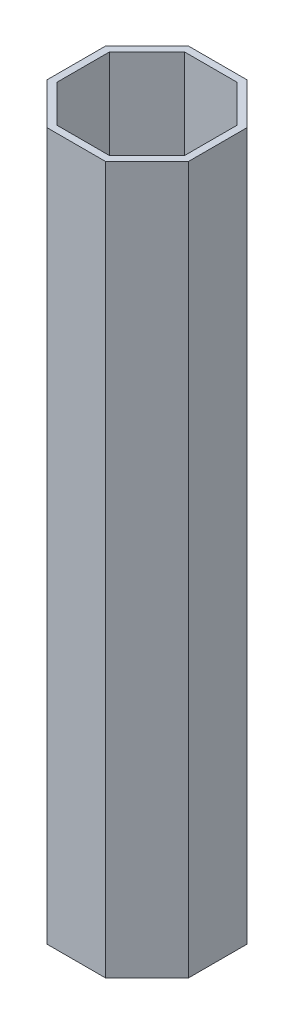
ISO-10303-21;
HEADER;
FILE_DESCRIPTION(('STEP AP214'),'2;1');
FILE_NAME('part.step','',(''),(''),'','','');
FILE_SCHEMA(('AUTOMOTIVE_DESIGN { 1 0 10303 214 1 1 1 1 }'));
ENDSEC;
DATA;
#1=APPLICATION_CONTEXT('core data for automotive mechanical design processes');
#2=APPLICATION_PROTOCOL_DEFINITION('international standard','automotive_design',2000,#1);
#3=PRODUCT_CONTEXT('',#1,'mechanical');
#4=PRODUCT('Part','Part','',(#3));
#5=PRODUCT_RELATED_PRODUCT_CATEGORY('part','',(#4));
#6=PRODUCT_DEFINITION_FORMATION('','',#4);
#7=PRODUCT_DEFINITION_CONTEXT('part definition',#1,'design');
#8=PRODUCT_DEFINITION('design','',#6,#7);
#9=PRODUCT_DEFINITION_SHAPE('','',#8);
#10=(LENGTH_UNIT() NAMED_UNIT(*) SI_UNIT(.MILLI.,.METRE.));
#11=(NAMED_UNIT(*) PLANE_ANGLE_UNIT() SI_UNIT($,.RADIAN.));
#12=(NAMED_UNIT(*) SI_UNIT($,.STERADIAN.) SOLID_ANGLE_UNIT());
#13=UNCERTAINTY_MEASURE_WITH_UNIT(LENGTH_MEASURE(1.E-05),#10,'distance_accuracy_value','');
#14=(GEOMETRIC_REPRESENTATION_CONTEXT(3) GLOBAL_UNCERTAINTY_ASSIGNED_CONTEXT((#13)) GLOBAL_UNIT_ASSIGNED_CONTEXT((#10,
#11,#12)) REPRESENTATION_CONTEXT('',''));
#15=CARTESIAN_POINT('',(0.,0.,0.));
#16=DIRECTION('',(0.,0.,1.));
#17=DIRECTION('',(1.,0.,0.));
#18=AXIS2_PLACEMENT_3D('',#15,#16,#17);
#19=CARTESIAN_POINT('',(-41.4213562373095,1000.,100.));
#20=DIRECTION('',(0.,0.,-1.));
#21=DIRECTION('',(-1.,0.,0.));
#22=AXIS2_PLACEMENT_3D('',#19,#20,#21);
#23=PLANE('',#22);
#24=DIRECTION('',(1.,0.,0.));
#25=VECTOR('',#24,1.);
#26=CARTESIAN_POINT('',(-41.4213562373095,0.,100.));
#27=LINE('',#26,#25);
#28=CARTESIAN_POINT('',(-41.4213562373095,0.,100.));
#29=VERTEX_POINT('',#28);
#30=CARTESIAN_POINT('',(41.4213562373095,0.,100.));
#31=VERTEX_POINT('',#30);
#32=EDGE_CURVE('E218',#29,#31,#27,.T.);
#33=ORIENTED_EDGE('',*,*,#32,.T.);
#34=DIRECTION('',(0.,-1.,0.));
#35=VECTOR('',#34,1.);
#36=CARTESIAN_POINT('',(41.4213562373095,1000.,100.));
#37=LINE('',#36,#35);
#38=CARTESIAN_POINT('',(41.4213562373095,1000.,100.));
#39=VERTEX_POINT('',#38);
#40=EDGE_CURVE('E11',#39,#31,#37,.T.);
#41=ORIENTED_EDGE('',*,*,#40,.F.);
#42=DIRECTION('',(1.,0.,0.));
#43=VECTOR('',#42,1.);
#44=CARTESIAN_POINT('',(-41.4213562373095,1000.,100.));
#45=LINE('',#44,#43);
#46=CARTESIAN_POINT('',(-41.4213562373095,1000.,100.));
#47=VERTEX_POINT('',#46);
#48=EDGE_CURVE('E199',#47,#39,#45,.T.);
#49=ORIENTED_EDGE('',*,*,#48,.F.);
#50=DIRECTION('',(0.,-1.,0.));
#51=VECTOR('',#50,1.);
#52=CARTESIAN_POINT('',(-41.4213562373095,1000.,100.));
#53=LINE('',#52,#51);
#54=EDGE_CURVE('E217',#47,#29,#53,.T.);
#55=ORIENTED_EDGE('',*,*,#54,.T.);
#56=EDGE_LOOP('',(#33,#41,#49,#55));
#57=FACE_BOUND('',#56,.T.);
#58=ADVANCED_FACE('F33',(#57),#23,.F.);
#59=CARTESIAN_POINT('',(41.4213562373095,1000.,100.));
#60=DIRECTION('',(-0.707106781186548,0.,-0.707106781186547));
#61=DIRECTION('',(-0.707106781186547,0.,0.707106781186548));
#62=AXIS2_PLACEMENT_3D('',#59,#60,#61);
#63=PLANE('',#62);
#64=DIRECTION('',(0.707106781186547,0.,-0.707106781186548));
#65=VECTOR('',#64,1.);
#66=CARTESIAN_POINT('',(41.4213562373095,0.,100.));
#67=LINE('',#66,#65);
#68=CARTESIAN_POINT('',(100.,0.,41.4213562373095));
#69=VERTEX_POINT('',#68);
#70=EDGE_CURVE('E221',#31,#69,#67,.T.);
#71=ORIENTED_EDGE('',*,*,#70,.T.);
#72=DIRECTION('',(0.,-1.,0.));
#73=VECTOR('',#72,1.);
#74=CARTESIAN_POINT('',(100.,1000.,41.4213562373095));
#75=LINE('',#74,#73);
#76=CARTESIAN_POINT('',(100.,1000.,41.4213562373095));
#77=VERTEX_POINT('',#76);
#78=EDGE_CURVE('E40',#77,#69,#75,.T.);
#79=ORIENTED_EDGE('',*,*,#78,.F.);
#80=DIRECTION('',(0.707106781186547,0.,-0.707106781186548));
#81=VECTOR('',#80,1.);
#82=CARTESIAN_POINT('',(41.4213562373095,1000.,100.));
#83=LINE('',#82,#81);
#84=EDGE_CURVE('E202',#39,#77,#83,.T.);
#85=ORIENTED_EDGE('',*,*,#84,.F.);
#86=ORIENTED_EDGE('',*,*,#40,.T.);
#87=EDGE_LOOP('',(#71,#79,#85,#86));
#88=FACE_BOUND('',#87,.T.);
#89=ADVANCED_FACE('F276',(#88),#63,.F.);
#90=CARTESIAN_POINT('',(100.,1000.,41.4213562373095));
#91=DIRECTION('',(-1.,0.,0.));
#92=DIRECTION('',(0.,0.,1.));
#93=AXIS2_PLACEMENT_3D('',#90,#91,#92);
#94=PLANE('',#93);
#95=DIRECTION('',(0.,0.,-1.));
#96=VECTOR('',#95,1.);
#97=CARTESIAN_POINT('',(100.,0.,41.4213562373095));
#98=LINE('',#97,#96);
#99=CARTESIAN_POINT('',(100.,0.,-41.4213562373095));
#100=VERTEX_POINT('',#99);
#101=EDGE_CURVE('E223',#69,#100,#98,.T.);
#102=ORIENTED_EDGE('',*,*,#101,.T.);
#103=DIRECTION('',(0.,-1.,0.));
#104=VECTOR('',#103,1.);
#105=CARTESIAN_POINT('',(100.,1000.,-41.4213562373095));
#106=LINE('',#105,#104);
#107=CARTESIAN_POINT('',(100.,1000.,-41.4213562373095));
#108=VERTEX_POINT('',#107);
#109=EDGE_CURVE('E248',#108,#100,#106,.T.);
#110=ORIENTED_EDGE('',*,*,#109,.F.);
#111=DIRECTION('',(0.,0.,-1.));
#112=VECTOR('',#111,1.);
#113=CARTESIAN_POINT('',(100.,1000.,41.4213562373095));
#114=LINE('',#113,#112);
#115=EDGE_CURVE('E205',#77,#108,#114,.T.);
#116=ORIENTED_EDGE('',*,*,#115,.F.);
#117=ORIENTED_EDGE('',*,*,#78,.T.);
#118=EDGE_LOOP('',(#102,#110,#116,#117));
#119=FACE_BOUND('',#118,.T.);
#120=ADVANCED_FACE('F255',(#119),#94,.F.);
#121=CARTESIAN_POINT('',(100.,1000.,-41.4213562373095));
#122=DIRECTION('',(-0.707106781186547,0.,0.707106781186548));
#123=DIRECTION('',(0.707106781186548,0.,0.707106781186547));
#124=AXIS2_PLACEMENT_3D('',#121,#122,#123);
#125=PLANE('',#124);
#126=DIRECTION('',(-0.707106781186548,0.,-0.707106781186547));
#127=VECTOR('',#126,1.);
#128=CARTESIAN_POINT('',(100.,0.,-41.4213562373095));
#129=LINE('',#128,#127);
#130=CARTESIAN_POINT('',(41.4213562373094,0.,-100.));
#131=VERTEX_POINT('',#130);
#132=EDGE_CURVE('E225',#100,#131,#129,.T.);
#133=ORIENTED_EDGE('',*,*,#132,.T.);
#134=DIRECTION('',(0.,-1.,0.));
#135=VECTOR('',#134,1.);
#136=CARTESIAN_POINT('',(41.4213562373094,1000.,-100.));
#137=LINE('',#136,#135);
#138=CARTESIAN_POINT('',(41.4213562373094,1000.,-100.));
#139=VERTEX_POINT('',#138);
#140=EDGE_CURVE('E245',#139,#131,#137,.T.);
#141=ORIENTED_EDGE('',*,*,#140,.F.);
#142=DIRECTION('',(-0.707106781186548,0.,-0.707106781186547));
#143=VECTOR('',#142,1.);
#144=CARTESIAN_POINT('',(100.,1000.,-41.4213562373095));
#145=LINE('',#144,#143);
#146=EDGE_CURVE('E207',#108,#139,#145,.T.);
#147=ORIENTED_EDGE('',*,*,#146,.F.);
#148=ORIENTED_EDGE('',*,*,#109,.T.);
#149=EDGE_LOOP('',(#133,#141,#147,#148));
#150=FACE_BOUND('',#149,.T.);
#151=ADVANCED_FACE('F264',(#150),#125,.F.);
#152=CARTESIAN_POINT('',(41.4213562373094,1000.,-100.));
#153=DIRECTION('',(0.,0.,1.));
#154=DIRECTION('',(1.,0.,0.));
#155=AXIS2_PLACEMENT_3D('',#152,#153,#154);
#156=PLANE('',#155);
#157=DIRECTION('',(-1.,0.,0.));
#158=VECTOR('',#157,1.);
#159=CARTESIAN_POINT('',(41.4213562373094,0.,-100.));
#160=LINE('',#159,#158);
#161=CARTESIAN_POINT('',(-41.4213562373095,0.,-100.));
#162=VERTEX_POINT('',#161);
#163=EDGE_CURVE('E227',#131,#162,#160,.T.);
#164=ORIENTED_EDGE('',*,*,#163,.T.);
#165=DIRECTION('',(0.,-1.,0.));
#166=VECTOR('',#165,1.);
#167=CARTESIAN_POINT('',(-41.4213562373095,1000.,-100.));
#168=LINE('',#167,#166);
#169=CARTESIAN_POINT('',(-41.4213562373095,1000.,-100.));
#170=VERTEX_POINT('',#169);
#171=EDGE_CURVE('E242',#170,#162,#168,.T.);
#172=ORIENTED_EDGE('',*,*,#171,.F.);
#173=DIRECTION('',(-1.,0.,0.));
#174=VECTOR('',#173,1.);
#175=CARTESIAN_POINT('',(41.4213562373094,1000.,-100.));
#176=LINE('',#175,#174);
#177=EDGE_CURVE('E209',#139,#170,#176,.T.);
#178=ORIENTED_EDGE('',*,*,#177,.F.);
#179=ORIENTED_EDGE('',*,*,#140,.T.);
#180=EDGE_LOOP('',(#164,#172,#178,#179));
#181=FACE_BOUND('',#180,.T.);
#182=ADVANCED_FACE('F268',(#181),#156,.F.);
#183=CARTESIAN_POINT('',(-41.4213562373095,1000.,-100.));
#184=DIRECTION('',(0.707106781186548,0.,0.707106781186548));
#185=DIRECTION('',(0.707106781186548,0.,-0.707106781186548));
#186=AXIS2_PLACEMENT_3D('',#183,#184,#185);
#187=PLANE('',#186);
#188=DIRECTION('',(-0.707106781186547,0.,0.707106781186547));
#189=VECTOR('',#188,1.);
#190=CARTESIAN_POINT('',(-41.4213562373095,0.,-100.));
#191=LINE('',#190,#189);
#192=CARTESIAN_POINT('',(-100.,0.,-41.4213562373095));
#193=VERTEX_POINT('',#192);
#194=EDGE_CURVE('E229',#162,#193,#191,.T.);
#195=ORIENTED_EDGE('',*,*,#194,.T.);
#196=DIRECTION('',(0.,-1.,0.));
#197=VECTOR('',#196,1.);
#198=CARTESIAN_POINT('',(-100.,1000.,-41.4213562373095));
#199=LINE('',#198,#197);
#200=CARTESIAN_POINT('',(-100.,1000.,-41.4213562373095));
#201=VERTEX_POINT('',#200);
#202=EDGE_CURVE('E239',#201,#193,#199,.T.);
#203=ORIENTED_EDGE('',*,*,#202,.F.);
#204=DIRECTION('',(-0.707106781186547,0.,0.707106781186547));
#205=VECTOR('',#204,1.);
#206=CARTESIAN_POINT('',(-41.4213562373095,1000.,-100.));
#207=LINE('',#206,#205);
#208=EDGE_CURVE('E211',#170,#201,#207,.T.);
#209=ORIENTED_EDGE('',*,*,#208,.F.);
#210=ORIENTED_EDGE('',*,*,#171,.T.);
#211=EDGE_LOOP('',(#195,#203,#209,#210));
#212=FACE_BOUND('',#211,.T.);
#213=ADVANCED_FACE('F289',(#212),#187,.F.);
#214=CARTESIAN_POINT('',(-100.,1000.,-41.4213562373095));
#215=DIRECTION('',(1.,0.,0.));
#216=DIRECTION('',(0.,0.,-1.));
#217=AXIS2_PLACEMENT_3D('',#214,#215,#216);
#218=PLANE('',#217);
#219=DIRECTION('',(0.,0.,1.));
#220=VECTOR('',#219,1.);
#221=CARTESIAN_POINT('',(-100.,0.,-41.4213562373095));
#222=LINE('',#221,#220);
#223=CARTESIAN_POINT('',(-100.,0.,41.4213562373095));
#224=VERTEX_POINT('',#223);
#225=EDGE_CURVE('E231',#193,#224,#222,.T.);
#226=ORIENTED_EDGE('',*,*,#225,.T.);
#227=DIRECTION('',(0.,-1.,0.));
#228=VECTOR('',#227,1.);
#229=CARTESIAN_POINT('',(-100.,1000.,41.4213562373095));
#230=LINE('',#229,#228);
#231=CARTESIAN_POINT('',(-100.,1000.,41.4213562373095));
#232=VERTEX_POINT('',#231);
#233=EDGE_CURVE('E236',#232,#224,#230,.T.);
#234=ORIENTED_EDGE('',*,*,#233,.F.);
#235=DIRECTION('',(0.,0.,1.));
#236=VECTOR('',#235,1.);
#237=CARTESIAN_POINT('',(-100.,1000.,-41.4213562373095));
#238=LINE('',#237,#236);
#239=EDGE_CURVE('E213',#201,#232,#238,.T.);
#240=ORIENTED_EDGE('',*,*,#239,.F.);
#241=ORIENTED_EDGE('',*,*,#202,.T.);
#242=EDGE_LOOP('',(#226,#234,#240,#241));
#243=FACE_BOUND('',#242,.T.);
#244=ADVANCED_FACE('F287',(#243),#218,.F.);
#245=CARTESIAN_POINT('',(-100.,1000.,41.4213562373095));
#246=DIRECTION('',(0.707106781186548,0.,-0.707106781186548));
#247=DIRECTION('',(-0.707106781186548,0.,-0.707106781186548));
#248=AXIS2_PLACEMENT_3D('',#245,#246,#247);
#249=PLANE('',#248);
#250=DIRECTION('',(0.707106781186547,0.,0.707106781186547));
#251=VECTOR('',#250,1.);
#252=CARTESIAN_POINT('',(-100.,0.,41.4213562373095));
#253=LINE('',#252,#251);
#254=EDGE_CURVE('E203',#224,#29,#253,.T.);
#255=ORIENTED_EDGE('',*,*,#254,.T.);
#256=ORIENTED_EDGE('',*,*,#54,.F.);
#257=DIRECTION('',(0.707106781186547,0.,0.707106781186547));
#258=VECTOR('',#257,1.);
#259=CARTESIAN_POINT('',(-100.,1000.,41.4213562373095));
#260=LINE('',#259,#258);
#261=EDGE_CURVE('E215',#232,#47,#260,.T.);
#262=ORIENTED_EDGE('',*,*,#261,.F.);
#263=ORIENTED_EDGE('',*,*,#233,.T.);
#264=EDGE_LOOP('',(#255,#256,#262,#263));
#265=FACE_BOUND('',#264,.T.);
#266=ADVANCED_FACE('F282',(#265),#249,.F.);
#267=CARTESIAN_POINT('',(0.,1000.,0.));
#268=DIRECTION('',(0.,1.,0.));
#269=DIRECTION('',(0.,0.,1.));
#270=AXIS2_PLACEMENT_3D('',#267,#268,#269);
#271=PLANE('',#270);
#272=DIRECTION('',(1.,0.,0.));
#273=VECTOR('',#272,1.);
#274=CARTESIAN_POINT('',(-41.4213562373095,1000.,90.));
#275=LINE('',#274,#273);
#276=CARTESIAN_POINT('',(-37.2792206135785,1000.,90.));
#277=VERTEX_POINT('',#276);
#278=CARTESIAN_POINT('',(37.2792206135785,1000.,90.));
#279=VERTEX_POINT('',#278);
#280=EDGE_CURVE('E170',#277,#279,#275,.T.);
#281=ORIENTED_EDGE('',*,*,#280,.F.);
#282=DIRECTION('',(0.707106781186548,0.,0.707106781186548));
#283=VECTOR('',#282,1.);
#284=CARTESIAN_POINT('',(-92.9289321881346,1000.,34.350288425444));
#285=LINE('',#284,#283);
#286=CARTESIAN_POINT('',(-90.,1000.,37.2792206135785));
#287=VERTEX_POINT('',#286);
#288=EDGE_CURVE('E151',#287,#277,#285,.T.);
#289=ORIENTED_EDGE('',*,*,#288,.F.);
#290=DIRECTION('',(0.,0.,1.));
#291=VECTOR('',#290,1.);
#292=CARTESIAN_POINT('',(-90.0000000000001,1000.,-41.4213562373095));
#293=LINE('',#292,#291);
#294=CARTESIAN_POINT('',(-90.0000000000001,1000.,-37.2792206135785));
#295=VERTEX_POINT('',#294);
#296=EDGE_CURVE('E196',#295,#287,#293,.T.);
#297=ORIENTED_EDGE('',*,*,#296,.F.);
#298=DIRECTION('',(-0.707106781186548,0.,0.707106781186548));
#299=VECTOR('',#298,1.);
#300=CARTESIAN_POINT('',(-34.350288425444,1000.,-92.9289321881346));
#301=LINE('',#300,#299);
#302=CARTESIAN_POINT('',(-37.2792206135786,1000.,-90.));
#303=VERTEX_POINT('',#302);
#304=EDGE_CURVE('E194',#303,#295,#301,.T.);
#305=ORIENTED_EDGE('',*,*,#304,.F.);
#306=DIRECTION('',(-1.,0.,0.));
#307=VECTOR('',#306,1.);
#308=CARTESIAN_POINT('',(41.4213562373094,1000.,-90.0000000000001));
#309=LINE('',#308,#307);
#310=CARTESIAN_POINT('',(37.2792206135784,1000.,-90.0000000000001));
#311=VERTEX_POINT('',#310);
#312=EDGE_CURVE('E192',#311,#303,#309,.T.);
#313=ORIENTED_EDGE('',*,*,#312,.F.);
#314=DIRECTION('',(-0.707106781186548,0.,-0.707106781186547));
#315=VECTOR('',#314,1.);
#316=CARTESIAN_POINT('',(92.9289321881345,1000.,-34.350288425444));
#317=LINE('',#316,#315);
#318=CARTESIAN_POINT('',(90.,1000.,-37.2792206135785));
#319=VERTEX_POINT('',#318);
#320=EDGE_CURVE('E190',#319,#311,#317,.T.);
#321=ORIENTED_EDGE('',*,*,#320,.F.);
#322=DIRECTION('',(0.,0.,-1.));
#323=VECTOR('',#322,1.);
#324=CARTESIAN_POINT('',(90.,1000.,41.4213562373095));
#325=LINE('',#324,#323);
#326=CARTESIAN_POINT('',(90.,1000.,37.2792206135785));
#327=VERTEX_POINT('',#326);
#328=EDGE_CURVE('E188',#327,#319,#325,.T.);
#329=ORIENTED_EDGE('',*,*,#328,.F.);
#330=DIRECTION('',(0.707106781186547,0.,-0.707106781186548));
#331=VECTOR('',#330,1.);
#332=CARTESIAN_POINT('',(34.350288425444,1000.,92.9289321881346));
#333=LINE('',#332,#331);
#334=EDGE_CURVE('E172',#279,#327,#333,.T.);
#335=ORIENTED_EDGE('',*,*,#334,.F.);
#336=EDGE_LOOP('',(#281,#289,#297,#305,#313,#321,#329,#335));
#337=FACE_BOUND('',#336,.T.);
#338=ORIENTED_EDGE('',*,*,#48,.T.);
#339=ORIENTED_EDGE('',*,*,#84,.T.);
#340=ORIENTED_EDGE('',*,*,#115,.T.);
#341=ORIENTED_EDGE('',*,*,#146,.T.);
#342=ORIENTED_EDGE('',*,*,#177,.T.);
#343=ORIENTED_EDGE('',*,*,#208,.T.);
#344=ORIENTED_EDGE('',*,*,#239,.T.);
#345=ORIENTED_EDGE('',*,*,#261,.T.);
#346=EDGE_LOOP('',(#338,#339,#340,#341,#342,#343,#344,#345));
#347=FACE_BOUND('',#346,.T.);
#348=ADVANCED_FACE('F272',(#337,#347),#271,.T.);
#349=CARTESIAN_POINT('',(0.,0.,0.));
#350=DIRECTION('',(0.,1.,0.));
#351=DIRECTION('',(0.,0.,1.));
#352=AXIS2_PLACEMENT_3D('',#349,#350,#351);
#353=PLANE('',#352);
#354=DIRECTION('',(0.707106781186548,0.,0.707106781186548));
#355=VECTOR('',#354,1.);
#356=CARTESIAN_POINT('',(-92.9289321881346,0.,34.350288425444));
#357=LINE('',#356,#355);
#358=CARTESIAN_POINT('',(-90.,0.,37.2792206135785));
#359=VERTEX_POINT('',#358);
#360=CARTESIAN_POINT('',(-37.2792206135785,0.,90.));
#361=VERTEX_POINT('',#360);
#362=EDGE_CURVE('E148',#359,#361,#357,.T.);
#363=ORIENTED_EDGE('',*,*,#362,.T.);
#364=DIRECTION('',(1.,0.,0.));
#365=VECTOR('',#364,1.);
#366=CARTESIAN_POINT('',(-41.4213562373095,0.,90.));
#367=LINE('',#366,#365);
#368=CARTESIAN_POINT('',(37.2792206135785,0.,90.));
#369=VERTEX_POINT('',#368);
#370=EDGE_CURVE('E157',#361,#369,#367,.T.);
#371=ORIENTED_EDGE('',*,*,#370,.T.);
#372=DIRECTION('',(0.707106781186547,0.,-0.707106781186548));
#373=VECTOR('',#372,1.);
#374=CARTESIAN_POINT('',(34.350288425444,0.,92.9289321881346));
#375=LINE('',#374,#373);
#376=CARTESIAN_POINT('',(90.,0.,37.2792206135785));
#377=VERTEX_POINT('',#376);
#378=EDGE_CURVE('E163',#369,#377,#375,.T.);
#379=ORIENTED_EDGE('',*,*,#378,.T.);
#380=DIRECTION('',(0.,0.,-1.));
#381=VECTOR('',#380,1.);
#382=CARTESIAN_POINT('',(90.,0.,41.4213562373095));
#383=LINE('',#382,#381);
#384=CARTESIAN_POINT('',(90.,0.,-37.2792206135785));
#385=VERTEX_POINT('',#384);
#386=EDGE_CURVE('E55',#377,#385,#383,.T.);
#387=ORIENTED_EDGE('',*,*,#386,.T.);
#388=DIRECTION('',(-0.707106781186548,0.,-0.707106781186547));
#389=VECTOR('',#388,1.);
#390=CARTESIAN_POINT('',(92.9289321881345,0.,-34.350288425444));
#391=LINE('',#390,#389);
#392=CARTESIAN_POINT('',(37.2792206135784,0.,-90.0000000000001));
#393=VERTEX_POINT('',#392);
#394=EDGE_CURVE('E182',#385,#393,#391,.T.);
#395=ORIENTED_EDGE('',*,*,#394,.T.);
#396=DIRECTION('',(-1.,0.,0.));
#397=VECTOR('',#396,1.);
#398=CARTESIAN_POINT('',(41.4213562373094,0.,-90.0000000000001));
#399=LINE('',#398,#397);
#400=CARTESIAN_POINT('',(-37.2792206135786,0.,-90.));
#401=VERTEX_POINT('',#400);
#402=EDGE_CURVE('E179',#393,#401,#399,.T.);
#403=ORIENTED_EDGE('',*,*,#402,.T.);
#404=DIRECTION('',(-0.707106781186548,0.,0.707106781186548));
#405=VECTOR('',#404,1.);
#406=CARTESIAN_POINT('',(-34.350288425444,0.,-92.9289321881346));
#407=LINE('',#406,#405);
#408=CARTESIAN_POINT('',(-90.0000000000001,0.,-37.2792206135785));
#409=VERTEX_POINT('',#408);
#410=EDGE_CURVE('E174',#401,#409,#407,.T.);
#411=ORIENTED_EDGE('',*,*,#410,.T.);
#412=DIRECTION('',(0.,0.,1.));
#413=VECTOR('',#412,1.);
#414=CARTESIAN_POINT('',(-90.0000000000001,0.,-41.4213562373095));
#415=LINE('',#414,#413);
#416=EDGE_CURVE('E169',#409,#359,#415,.T.);
#417=ORIENTED_EDGE('',*,*,#416,.T.);
#418=EDGE_LOOP('',(#363,#371,#379,#387,#395,#403,#411,#417));
#419=FACE_BOUND('',#418,.T.);
#420=ORIENTED_EDGE('',*,*,#32,.F.);
#421=ORIENTED_EDGE('',*,*,#254,.F.);
#422=ORIENTED_EDGE('',*,*,#225,.F.);
#423=ORIENTED_EDGE('',*,*,#194,.F.);
#424=ORIENTED_EDGE('',*,*,#163,.F.);
#425=ORIENTED_EDGE('',*,*,#132,.F.);
#426=ORIENTED_EDGE('',*,*,#101,.F.);
#427=ORIENTED_EDGE('',*,*,#70,.F.);
#428=EDGE_LOOP('',(#420,#421,#422,#423,#424,#425,#426,#427));
#429=FACE_BOUND('',#428,.T.);
#430=ADVANCED_FACE('F165',(#419,#429),#353,.F.);
#431=CARTESIAN_POINT('',(-41.4213562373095,1000.,90.));
#432=DIRECTION('',(0.,0.,-1.));
#433=DIRECTION('',(-1.,0.,0.));
#434=AXIS2_PLACEMENT_3D('',#431,#432,#433);
#435=PLANE('',#434);
#436=ORIENTED_EDGE('',*,*,#370,.F.);
#437=DIRECTION('',(0.,-1.,0.));
#438=VECTOR('',#437,1.);
#439=CARTESIAN_POINT('',(-37.2792206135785,1000.,90.));
#440=LINE('',#439,#438);
#441=EDGE_CURVE('E144',#277,#361,#440,.T.);
#442=ORIENTED_EDGE('',*,*,#441,.F.);
#443=ORIENTED_EDGE('',*,*,#280,.T.);
#444=DIRECTION('',(0.,-1.,0.));
#445=VECTOR('',#444,1.);
#446=CARTESIAN_POINT('',(37.2792206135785,1000.,90.));
#447=LINE('',#446,#445);
#448=EDGE_CURVE('E160',#279,#369,#447,.T.);
#449=ORIENTED_EDGE('',*,*,#448,.T.);
#450=EDGE_LOOP('',(#436,#442,#443,#449));
#451=FACE_BOUND('',#450,.T.);
#452=ADVANCED_FACE('F158',(#451),#435,.T.);
#453=CARTESIAN_POINT('',(34.350288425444,1000.,92.9289321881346));
#454=DIRECTION('',(-0.707106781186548,0.,-0.707106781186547));
#455=DIRECTION('',(-0.707106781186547,0.,0.707106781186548));
#456=AXIS2_PLACEMENT_3D('',#453,#454,#455);
#457=PLANE('',#456);
#458=ORIENTED_EDGE('',*,*,#378,.F.);
#459=ORIENTED_EDGE('',*,*,#448,.F.);
#460=ORIENTED_EDGE('',*,*,#334,.T.);
#461=DIRECTION('',(0.,-1.,0.));
#462=VECTOR('',#461,1.);
#463=CARTESIAN_POINT('',(90.,1000.,37.2792206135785));
#464=LINE('',#463,#462);
#465=EDGE_CURVE('E445',#327,#377,#464,.T.);
#466=ORIENTED_EDGE('',*,*,#465,.T.);
#467=EDGE_LOOP('',(#458,#459,#460,#466));
#468=FACE_BOUND('',#467,.T.);
#469=ADVANCED_FACE('F360',(#468),#457,.T.);
#470=CARTESIAN_POINT('',(90.,1000.,41.4213562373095));
#471=DIRECTION('',(-1.,0.,0.));
#472=DIRECTION('',(0.,0.,1.));
#473=AXIS2_PLACEMENT_3D('',#470,#471,#472);
#474=PLANE('',#473);
#475=ORIENTED_EDGE('',*,*,#386,.F.);
#476=ORIENTED_EDGE('',*,*,#465,.F.);
#477=ORIENTED_EDGE('',*,*,#328,.T.);
#478=DIRECTION('',(0.,-1.,0.));
#479=VECTOR('',#478,1.);
#480=CARTESIAN_POINT('',(90.,1000.,-37.2792206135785));
#481=LINE('',#480,#479);
#482=EDGE_CURVE('E443',#319,#385,#481,.T.);
#483=ORIENTED_EDGE('',*,*,#482,.T.);
#484=EDGE_LOOP('',(#475,#476,#477,#483));
#485=FACE_BOUND('',#484,.T.);
#486=ADVANCED_FACE('F369',(#485),#474,.T.);
#487=CARTESIAN_POINT('',(92.9289321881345,1000.,-34.350288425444));
#488=DIRECTION('',(-0.707106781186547,0.,0.707106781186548));
#489=DIRECTION('',(0.707106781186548,0.,0.707106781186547));
#490=AXIS2_PLACEMENT_3D('',#487,#488,#489);
#491=PLANE('',#490);
#492=ORIENTED_EDGE('',*,*,#394,.F.);
#493=ORIENTED_EDGE('',*,*,#482,.F.);
#494=ORIENTED_EDGE('',*,*,#320,.T.);
#495=DIRECTION('',(0.,-1.,0.));
#496=VECTOR('',#495,1.);
#497=CARTESIAN_POINT('',(37.2792206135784,1000.,-90.0000000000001));
#498=LINE('',#497,#496);
#499=EDGE_CURVE('E439',#311,#393,#498,.T.);
#500=ORIENTED_EDGE('',*,*,#499,.T.);
#501=EDGE_LOOP('',(#492,#493,#494,#500));
#502=FACE_BOUND('',#501,.T.);
#503=ADVANCED_FACE('F379',(#502),#491,.T.);
#504=CARTESIAN_POINT('',(41.4213562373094,1000.,-90.0000000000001));
#505=DIRECTION('',(0.,0.,1.));
#506=DIRECTION('',(1.,0.,0.));
#507=AXIS2_PLACEMENT_3D('',#504,#505,#506);
#508=PLANE('',#507);
#509=ORIENTED_EDGE('',*,*,#402,.F.);
#510=ORIENTED_EDGE('',*,*,#499,.F.);
#511=ORIENTED_EDGE('',*,*,#312,.T.);
#512=DIRECTION('',(0.,-1.,0.));
#513=VECTOR('',#512,1.);
#514=CARTESIAN_POINT('',(-37.2792206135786,1000.,-90.));
#515=LINE('',#514,#513);
#516=EDGE_CURVE('E436',#303,#401,#515,.T.);
#517=ORIENTED_EDGE('',*,*,#516,.T.);
#518=EDGE_LOOP('',(#509,#510,#511,#517));
#519=FACE_BOUND('',#518,.T.);
#520=ADVANCED_FACE('F388',(#519),#508,.T.);
#521=CARTESIAN_POINT('',(-34.350288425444,1000.,-92.9289321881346));
#522=DIRECTION('',(0.707106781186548,0.,0.707106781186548));
#523=DIRECTION('',(0.707106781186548,0.,-0.707106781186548));
#524=AXIS2_PLACEMENT_3D('',#521,#522,#523);
#525=PLANE('',#524);
#526=ORIENTED_EDGE('',*,*,#410,.F.);
#527=ORIENTED_EDGE('',*,*,#516,.F.);
#528=ORIENTED_EDGE('',*,*,#304,.T.);
#529=DIRECTION('',(0.,-1.,0.));
#530=VECTOR('',#529,1.);
#531=CARTESIAN_POINT('',(-90.0000000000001,1000.,-37.2792206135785));
#532=LINE('',#531,#530);
#533=EDGE_CURVE('E431',#295,#409,#532,.T.);
#534=ORIENTED_EDGE('',*,*,#533,.T.);
#535=EDGE_LOOP('',(#526,#527,#528,#534));
#536=FACE_BOUND('',#535,.T.);
#537=ADVANCED_FACE('F398',(#536),#525,.T.);
#538=CARTESIAN_POINT('',(-90.0000000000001,1000.,-41.4213562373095));
#539=DIRECTION('',(1.,0.,0.));
#540=DIRECTION('',(0.,0.,-1.));
#541=AXIS2_PLACEMENT_3D('',#538,#539,#540);
#542=PLANE('',#541);
#543=ORIENTED_EDGE('',*,*,#416,.F.);
#544=ORIENTED_EDGE('',*,*,#533,.F.);
#545=ORIENTED_EDGE('',*,*,#296,.T.);
#546=DIRECTION('',(0.,-1.,0.));
#547=VECTOR('',#546,1.);
#548=CARTESIAN_POINT('',(-90.,1000.,37.2792206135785));
#549=LINE('',#548,#547);
#550=EDGE_CURVE('E47',#287,#359,#549,.T.);
#551=ORIENTED_EDGE('',*,*,#550,.T.);
#552=EDGE_LOOP('',(#543,#544,#545,#551));
#553=FACE_BOUND('',#552,.T.);
#554=ADVANCED_FACE('F408',(#553),#542,.T.);
#555=CARTESIAN_POINT('',(-92.9289321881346,1000.,34.350288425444));
#556=DIRECTION('',(0.707106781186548,0.,-0.707106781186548));
#557=DIRECTION('',(-0.707106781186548,0.,-0.707106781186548));
#558=AXIS2_PLACEMENT_3D('',#555,#556,#557);
#559=PLANE('',#558);
#560=ORIENTED_EDGE('',*,*,#362,.F.);
#561=ORIENTED_EDGE('',*,*,#550,.F.);
#562=ORIENTED_EDGE('',*,*,#288,.T.);
#563=ORIENTED_EDGE('',*,*,#441,.T.);
#564=EDGE_LOOP('',(#560,#561,#562,#563));
#565=FACE_BOUND('',#564,.T.);
#566=ADVANCED_FACE('F146',(#565),#559,.T.);
#567=CLOSED_SHELL('',(#58,#89,#120,#151,#182,#213,#244,#266,#348,#430,#452,#469,#486,#503,#520,
#537,#554,#566));
#568=MANIFOLD_SOLID_BREP('B2',#567);
#569=ADVANCED_BREP_SHAPE_REPRESENTATION('',(#18,#568),#14);
#570=SHAPE_DEFINITION_REPRESENTATION(#9,#569);
ENDSEC;
END-ISO-10303-21;
